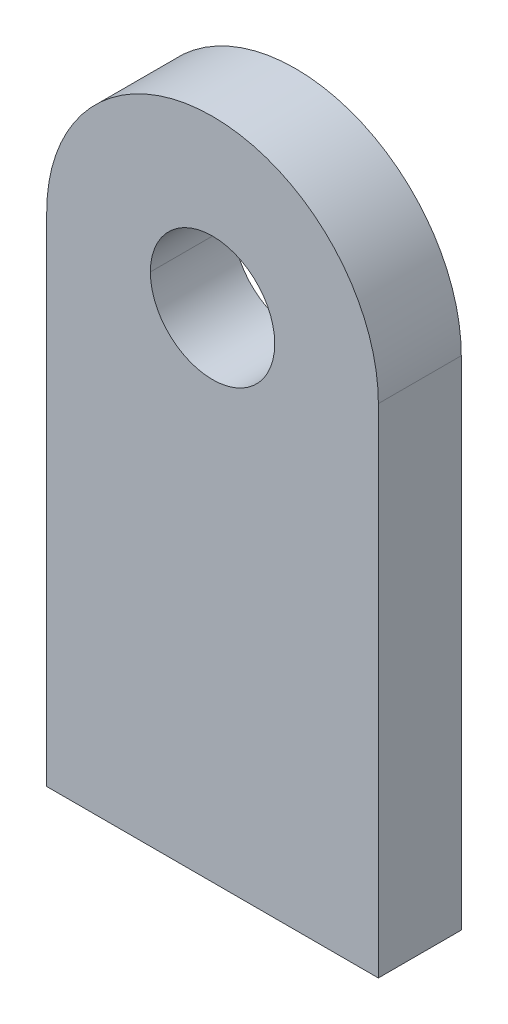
ISO-10303-21;
HEADER;
FILE_DESCRIPTION(('STEP AP214'),'2;1');
FILE_NAME('part.step','',(''),(''),'','','');
FILE_SCHEMA(('AUTOMOTIVE_DESIGN { 1 0 10303 214 1 1 1 1 }'));
ENDSEC;
DATA;
#1=APPLICATION_CONTEXT('core data for automotive mechanical design processes');
#2=APPLICATION_PROTOCOL_DEFINITION('international standard','automotive_design',2000,#1);
#3=PRODUCT_CONTEXT('',#1,'mechanical');
#4=PRODUCT('Part','Part','',(#3));
#5=PRODUCT_RELATED_PRODUCT_CATEGORY('part','',(#4));
#6=PRODUCT_DEFINITION_FORMATION('','',#4);
#7=PRODUCT_DEFINITION_CONTEXT('part definition',#1,'design');
#8=PRODUCT_DEFINITION('design','',#6,#7);
#9=PRODUCT_DEFINITION_SHAPE('','',#8);
#10=(LENGTH_UNIT() NAMED_UNIT(*) SI_UNIT(.MILLI.,.METRE.));
#11=(NAMED_UNIT(*) PLANE_ANGLE_UNIT() SI_UNIT($,.RADIAN.));
#12=(NAMED_UNIT(*) SI_UNIT($,.STERADIAN.) SOLID_ANGLE_UNIT());
#13=UNCERTAINTY_MEASURE_WITH_UNIT(LENGTH_MEASURE(1.E-05),#10,'distance_accuracy_value','');
#14=(GEOMETRIC_REPRESENTATION_CONTEXT(3) GLOBAL_UNCERTAINTY_ASSIGNED_CONTEXT((#13)) GLOBAL_UNIT_ASSIGNED_CONTEXT((#10,
#11,#12)) REPRESENTATION_CONTEXT('',''));
#15=CARTESIAN_POINT('',(0.,0.,0.));
#16=DIRECTION('',(0.,0.,1.));
#17=DIRECTION('',(1.,0.,0.));
#18=AXIS2_PLACEMENT_3D('',#15,#16,#17);
#19=CARTESIAN_POINT('',(0.,76.2,-6.35));
#20=DIRECTION('',(0.,0.,1.));
#21=DIRECTION('',(1.,0.,0.));
#22=AXIS2_PLACEMENT_3D('',#19,#20,#21);
#23=CYLINDRICAL_SURFACE('',#22,9.525);
#24=DIRECTION('',(0.,0.,1.));
#25=VECTOR('',#24,1.);
#26=CARTESIAN_POINT('',(9.525,76.2,-6.35));
#27=LINE('',#26,#25);
#28=CARTESIAN_POINT('',(9.525,76.2,6.35));
#29=VERTEX_POINT('',#28);
#30=CARTESIAN_POINT('',(9.525,76.2,-6.35));
#31=VERTEX_POINT('',#30);
#32=EDGE_CURVE('E11',#29,#31,#27,.F.);
#33=ORIENTED_EDGE('',*,*,#32,.F.);
#34=CARTESIAN_POINT('',(0.,76.2,6.35));
#35=DIRECTION('',(0.,0.,1.));
#36=DIRECTION('',(1.,0.,0.));
#37=AXIS2_PLACEMENT_3D('',#34,#35,#36);
#38=CIRCLE('',#37,9.525);
#39=CARTESIAN_POINT('',(-9.525,76.2,6.35));
#40=VERTEX_POINT('',#39);
#41=EDGE_CURVE('E130',#29,#40,#38,.T.);
#42=ORIENTED_EDGE('',*,*,#41,.T.);
#43=DIRECTION('',(0.,0.,1.));
#44=VECTOR('',#43,1.);
#45=CARTESIAN_POINT('',(-9.525,76.2,-6.35));
#46=LINE('',#45,#44);
#47=CARTESIAN_POINT('',(-9.525,76.2,-6.35));
#48=VERTEX_POINT('',#47);
#49=EDGE_CURVE('E40',#48,#40,#46,.T.);
#50=ORIENTED_EDGE('',*,*,#49,.F.);
#51=CARTESIAN_POINT('',(0.,76.2,-6.35));
#52=DIRECTION('',(0.,0.,1.));
#53=DIRECTION('',(1.,0.,0.));
#54=AXIS2_PLACEMENT_3D('',#51,#52,#53);
#55=CIRCLE('',#54,9.525);
#56=EDGE_CURVE('E127',#31,#48,#55,.T.);
#57=ORIENTED_EDGE('',*,*,#56,.F.);
#58=EDGE_LOOP('',(#33,#42,#50,#57));
#59=FACE_BOUND('',#58,.T.);
#60=ADVANCED_FACE('F36',(#59),#23,.F.);
#61=CARTESIAN_POINT('',(25.4,0.,6.35));
#62=DIRECTION('',(0.,1.,0.));
#63=DIRECTION('',(0.,0.,1.));
#64=AXIS2_PLACEMENT_3D('',#61,#62,#63);
#65=PLANE('',#64);
#66=DIRECTION('',(1.,0.,0.));
#67=VECTOR('',#66,1.);
#68=CARTESIAN_POINT('',(25.4,0.,-6.35));
#69=LINE('',#68,#67);
#70=CARTESIAN_POINT('',(-25.4,0.,-6.35));
#71=VERTEX_POINT('',#70);
#72=CARTESIAN_POINT('',(25.4,0.,-6.35));
#73=VERTEX_POINT('',#72);
#74=EDGE_CURVE('E111',#71,#73,#69,.T.);
#75=ORIENTED_EDGE('',*,*,#74,.T.);
#76=DIRECTION('',(0.,0.,-1.));
#77=VECTOR('',#76,1.);
#78=CARTESIAN_POINT('',(25.4,0.,6.35));
#79=LINE('',#78,#77);
#80=CARTESIAN_POINT('',(25.4,0.,6.35));
#81=VERTEX_POINT('',#80);
#82=EDGE_CURVE('E92',#81,#73,#79,.T.);
#83=ORIENTED_EDGE('',*,*,#82,.F.);
#84=DIRECTION('',(1.,0.,0.));
#85=VECTOR('',#84,1.);
#86=CARTESIAN_POINT('',(25.4,0.,6.35));
#87=LINE('',#86,#85);
#88=CARTESIAN_POINT('',(-25.4,0.,6.35));
#89=VERTEX_POINT('',#88);
#90=EDGE_CURVE('E99',#89,#81,#87,.T.);
#91=ORIENTED_EDGE('',*,*,#90,.F.);
#92=DIRECTION('',(0.,0.,-1.));
#93=VECTOR('',#92,1.);
#94=CARTESIAN_POINT('',(-25.4,0.,6.35));
#95=LINE('',#94,#93);
#96=EDGE_CURVE('E119',#89,#71,#95,.T.);
#97=ORIENTED_EDGE('',*,*,#96,.T.);
#98=EDGE_LOOP('',(#75,#83,#91,#97));
#99=FACE_BOUND('',#98,.T.);
#100=ADVANCED_FACE('F38',(#99),#65,.F.);
#101=CARTESIAN_POINT('',(25.4,76.2,6.35));
#102=DIRECTION('',(-1.,0.,0.));
#103=DIRECTION('',(0.,-1.,0.));
#104=AXIS2_PLACEMENT_3D('',#101,#102,#103);
#105=PLANE('',#104);
#106=DIRECTION('',(0.,1.,0.));
#107=VECTOR('',#106,1.);
#108=CARTESIAN_POINT('',(25.4,76.2,-6.35));
#109=LINE('',#108,#107);
#110=CARTESIAN_POINT('',(25.4,76.2,-6.35));
#111=VERTEX_POINT('',#110);
#112=EDGE_CURVE('E124',#73,#111,#109,.T.);
#113=ORIENTED_EDGE('',*,*,#112,.T.);
#114=DIRECTION('',(0.,0.,-1.));
#115=VECTOR('',#114,1.);
#116=CARTESIAN_POINT('',(25.4,76.2,6.35));
#117=LINE('',#116,#115);
#118=CARTESIAN_POINT('',(25.4,76.2,6.35));
#119=VERTEX_POINT('',#118);
#120=EDGE_CURVE('E95',#119,#111,#117,.T.);
#121=ORIENTED_EDGE('',*,*,#120,.F.);
#122=DIRECTION('',(0.,1.,0.));
#123=VECTOR('',#122,1.);
#124=CARTESIAN_POINT('',(25.4,76.2,6.35));
#125=LINE('',#124,#123);
#126=EDGE_CURVE('E88',#81,#119,#125,.T.);
#127=ORIENTED_EDGE('',*,*,#126,.F.);
#128=ORIENTED_EDGE('',*,*,#82,.T.);
#129=EDGE_LOOP('',(#113,#121,#127,#128));
#130=FACE_BOUND('',#129,.T.);
#131=ADVANCED_FACE('F90',(#130),#105,.F.);
#132=CARTESIAN_POINT('',(0.,76.2,6.35));
#133=DIRECTION('',(0.,0.,-1.));
#134=DIRECTION('',(-1.,0.,0.));
#135=AXIS2_PLACEMENT_3D('',#132,#133,#134);
#136=CYLINDRICAL_SURFACE('',#135,25.4);
#137=CARTESIAN_POINT('',(0.,76.2,-6.35));
#138=DIRECTION('',(0.,0.,1.));
#139=DIRECTION('',(-1.,0.,0.));
#140=AXIS2_PLACEMENT_3D('',#137,#138,#139);
#141=CIRCLE('',#140,25.4);
#142=CARTESIAN_POINT('',(-25.4,76.2,-6.35));
#143=VERTEX_POINT('',#142);
#144=EDGE_CURVE('E122',#111,#143,#141,.T.);
#145=ORIENTED_EDGE('',*,*,#144,.T.);
#146=DIRECTION('',(0.,0.,-1.));
#147=VECTOR('',#146,1.);
#148=CARTESIAN_POINT('',(-25.4,76.2,6.35));
#149=LINE('',#148,#147);
#150=CARTESIAN_POINT('',(-25.4,76.2,6.35));
#151=VERTEX_POINT('',#150);
#152=EDGE_CURVE('E114',#151,#143,#149,.T.);
#153=ORIENTED_EDGE('',*,*,#152,.F.);
#154=CARTESIAN_POINT('',(0.,76.2,6.35));
#155=DIRECTION('',(0.,0.,1.));
#156=DIRECTION('',(-1.,0.,0.));
#157=AXIS2_PLACEMENT_3D('',#154,#155,#156);
#158=CIRCLE('',#157,25.4);
#159=EDGE_CURVE('E98',#119,#151,#158,.T.);
#160=ORIENTED_EDGE('',*,*,#159,.F.);
#161=ORIENTED_EDGE('',*,*,#120,.T.);
#162=EDGE_LOOP('',(#145,#153,#160,#161));
#163=FACE_BOUND('',#162,.T.);
#164=ADVANCED_FACE('F156',(#163),#136,.T.);
#165=CARTESIAN_POINT('',(-25.4,0.,6.35));
#166=DIRECTION('',(1.,0.,0.));
#167=DIRECTION('',(0.,1.,0.));
#168=AXIS2_PLACEMENT_3D('',#165,#166,#167);
#169=PLANE('',#168);
#170=DIRECTION('',(0.,-1.,0.));
#171=VECTOR('',#170,1.);
#172=CARTESIAN_POINT('',(-25.4,0.,-6.35));
#173=LINE('',#172,#171);
#174=EDGE_CURVE('E108',#143,#71,#173,.T.);
#175=ORIENTED_EDGE('',*,*,#174,.T.);
#176=ORIENTED_EDGE('',*,*,#96,.F.);
#177=DIRECTION('',(0.,-1.,0.));
#178=VECTOR('',#177,1.);
#179=CARTESIAN_POINT('',(-25.4,0.,6.35));
#180=LINE('',#179,#178);
#181=EDGE_CURVE('E104',#151,#89,#180,.T.);
#182=ORIENTED_EDGE('',*,*,#181,.F.);
#183=ORIENTED_EDGE('',*,*,#152,.T.);
#184=EDGE_LOOP('',(#175,#176,#182,#183));
#185=FACE_BOUND('',#184,.T.);
#186=ADVANCED_FACE('F160',(#185),#169,.F.);
#187=CARTESIAN_POINT('',(0.,76.2,6.35));
#188=DIRECTION('',(0.,0.,-1.));
#189=DIRECTION('',(-1.,0.,0.));
#190=AXIS2_PLACEMENT_3D('',#187,#188,#189);
#191=PLANE('',#190);
#192=ORIENTED_EDGE('',*,*,#41,.F.);
#193=EDGE_CURVE('E133',#40,#29,#38,.T.);
#194=ORIENTED_EDGE('',*,*,#193,.F.);
#195=EDGE_LOOP('',(#192,#194));
#196=FACE_BOUND('',#195,.T.);
#197=ORIENTED_EDGE('',*,*,#90,.T.);
#198=ORIENTED_EDGE('',*,*,#126,.T.);
#199=ORIENTED_EDGE('',*,*,#159,.T.);
#200=ORIENTED_EDGE('',*,*,#181,.T.);
#201=EDGE_LOOP('',(#197,#198,#199,#200));
#202=FACE_BOUND('',#201,.T.);
#203=ADVANCED_FACE('F102',(#196,#202),#191,.F.);
#204=CARTESIAN_POINT('',(0.,76.2,-6.35));
#205=DIRECTION('',(0.,0.,-1.));
#206=DIRECTION('',(-1.,0.,0.));
#207=AXIS2_PLACEMENT_3D('',#204,#205,#206);
#208=PLANE('',#207);
#209=ORIENTED_EDGE('',*,*,#56,.T.);
#210=EDGE_CURVE('E132',#48,#31,#55,.T.);
#211=ORIENTED_EDGE('',*,*,#210,.T.);
#212=EDGE_LOOP('',(#209,#211));
#213=FACE_BOUND('',#212,.T.);
#214=ORIENTED_EDGE('',*,*,#74,.F.);
#215=ORIENTED_EDGE('',*,*,#174,.F.);
#216=ORIENTED_EDGE('',*,*,#144,.F.);
#217=ORIENTED_EDGE('',*,*,#112,.F.);
#218=EDGE_LOOP('',(#214,#215,#216,#217));
#219=FACE_BOUND('',#218,.T.);
#220=ADVANCED_FACE('F137',(#213,#219),#208,.T.);
#221=ORIENTED_EDGE('',*,*,#193,.T.);
#222=ORIENTED_EDGE('',*,*,#32,.T.);
#223=ORIENTED_EDGE('',*,*,#210,.F.);
#224=ORIENTED_EDGE('',*,*,#49,.T.);
#225=EDGE_LOOP('',(#221,#222,#223,#224));
#226=FACE_BOUND('',#225,.T.);
#227=ADVANCED_FACE('F141',(#226),#23,.F.);
#228=CLOSED_SHELL('',(#60,#100,#131,#164,#186,#203,#220,#227));
#229=MANIFOLD_SOLID_BREP('B2',#228);
#230=ADVANCED_BREP_SHAPE_REPRESENTATION('',(#18,#229),#14);
#231=SHAPE_DEFINITION_REPRESENTATION(#9,#230);
ENDSEC;
END-ISO-10303-21;
